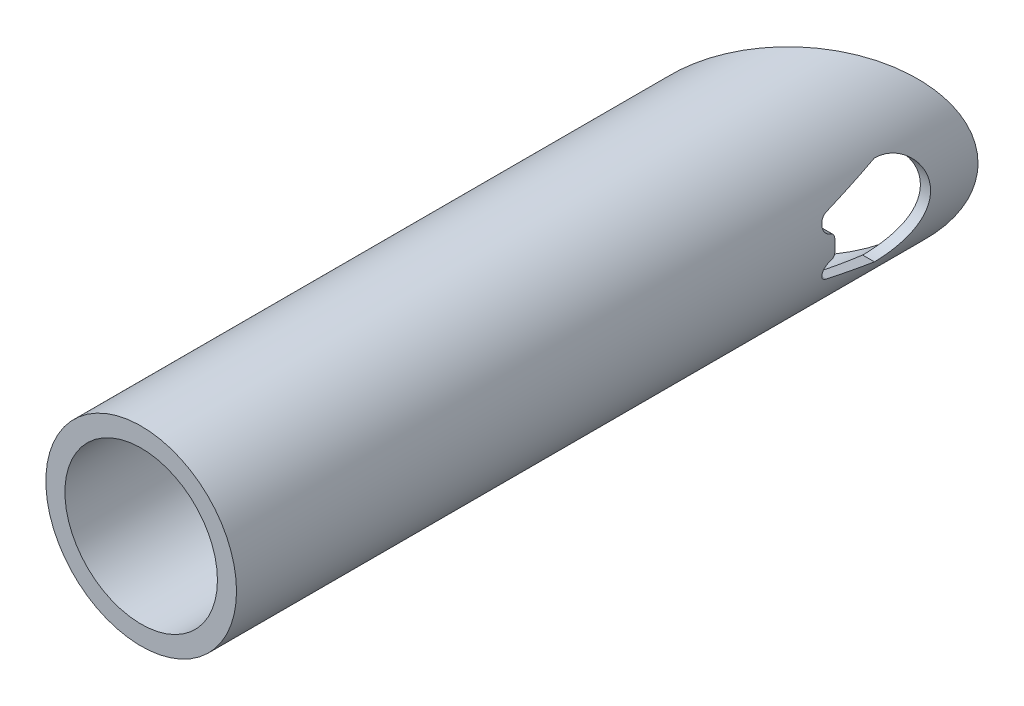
from build123d import *

# Parameters (mm, degrees)
SKETCH1_R               = 14.2875
SKETCH1_R_2             = 12.7635
BOSS_EXTRUDE1_DEPTH     = 111.125
CUT_EXTRUDE1_DEPTH      = 113.94702713
CUT_EXTRUDE1_DEPTH_BACK = 113.94702713
BOSS_EXTRUDE2_START     = -76.2
SKETCH3_R               = 14.2875
SKETCH3_R_2             = 11.43
BOSS_EXTRUDE2_DEPTH     = 76.2
SKETCH4_R               = 12.7635
BOSS_EXTRUDE3_DEPTH     = 5.08
CUT_EXTRUDE2_DEPTH      = 113.94702713
FILLET1_R               = 0.762


with BuildPart() as part:
    # Sketch1 → Boss-Extrude1 (new body)
    with BuildSketch(Plane.XY):
        Circle(SKETCH1_R)
        Circle(SKETCH1_R_2, mode=Mode.SUBTRACT)
    extrude(amount=BOSS_EXTRUDE1_DEPTH)

    # Sketch2 → Cut-Extrude1 (cut, two sides: drawn at the far end of the back side and taken through both)
    with BuildSketch(Plane(origin=(0, 0, 0), x_dir=(1, 0, 0), z_dir=(0, 1, 0)).offset(-CUT_EXTRUDE1_DEPTH_BACK)):
        Polygon((14.2875, 0), (-14.2875, -25.4), (-14.2875, 0), align=None)
    extrude(amount=CUT_EXTRUDE1_DEPTH + CUT_EXTRUDE1_DEPTH_BACK, mode=Mode.SUBTRACT)

    # Sketch3 → Boss-Extrude2 (add)
    with BuildSketch(Plane.XY.offset(111.125).offset(BOSS_EXTRUDE2_START)):
        Circle(SKETCH3_R)
        Circle(SKETCH3_R_2, mode=Mode.SUBTRACT)
    extrude(amount=BOSS_EXTRUDE2_DEPTH)

    # Sketch4 → Boss-Extrude3 (add)
    with BuildSketch(Plane(origin=(0, 0, 34.925), x_dir=(-1, 0, 0), z_dir=(0, 0, -1))):
        with Locations(Location((0, 0, 0), (0, 0, 180))):
            Circle(SKETCH4_R)
    extrude(amount=-BOSS_EXTRUDE3_DEPTH)

    # Sketch5 → Cut-Extrude2 (cut, through all)
    with BuildSketch(Plane(origin=(0, 0, 0), x_dir=(0, 0, -1), z_dir=(1, 0, 0))):
        with BuildLine():
            Line((-22.096972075, 4.343361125), (-13.843843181, 6.736648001))
            ThreePointArc((-13.843843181, 6.736648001), (-7.107195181, 0), (-13.843843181, -6.736648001))
            Line((-13.843843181, -6.736648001), (-22.096972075, -4.343361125))
            ThreePointArc((-22.096972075, -4.343361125), (-23.04306007, -3.175091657), (-22.276606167, -1.881845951))
            Line((-22.276606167, -1.881845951), (-21.433682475, -1.497363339))
            Line((-21.433682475, -1.497363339), (-21.433682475, 0))
            Line((-21.433682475, 0), (-21.433682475, 1.497363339))
            Line((-21.433682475, 1.497363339), (-22.276606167, 1.881845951))
            ThreePointArc((-22.276606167, 1.881845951), (-23.04306007, 3.175091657), (-22.096972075, 4.343361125))
        make_face()
    extrude(amount=CUT_EXTRUDE2_DEPTH, mode=Mode.SUBTRACT)

    # Fillet1
    fillet1_edges = [part.edges().sort_by_distance(p)[0] for p in [
        (13.442091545, -1.497363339, 21.433682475),
        (13.442091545, 1.497363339, 21.433682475),
    ]]
    fillet(fillet1_edges, radius=FILLET1_R)


solid = part.part
